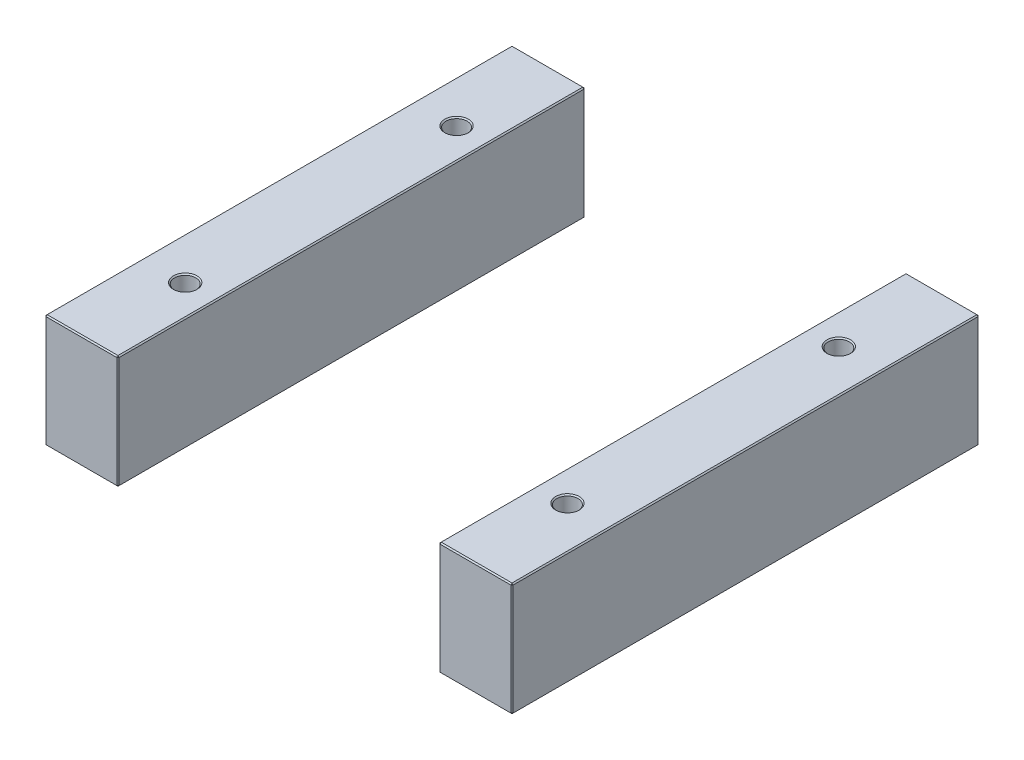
ISO-10303-21;
HEADER;
FILE_DESCRIPTION(('STEP AP214'),'2;1');
FILE_NAME('part.step','',(''),(''),'','','');
FILE_SCHEMA(('AUTOMOTIVE_DESIGN { 1 0 10303 214 1 1 1 1 }'));
ENDSEC;
DATA;
#1=APPLICATION_CONTEXT('core data for automotive mechanical design processes');
#2=APPLICATION_PROTOCOL_DEFINITION('international standard','automotive_design',2000,#1);
#3=PRODUCT_CONTEXT('',#1,'mechanical');
#4=PRODUCT('Part','Part','',(#3));
#5=PRODUCT_RELATED_PRODUCT_CATEGORY('part','',(#4));
#6=PRODUCT_DEFINITION_FORMATION('','',#4);
#7=PRODUCT_DEFINITION_CONTEXT('part definition',#1,'design');
#8=PRODUCT_DEFINITION('design','',#6,#7);
#9=PRODUCT_DEFINITION_SHAPE('','',#8);
#10=(LENGTH_UNIT() NAMED_UNIT(*) SI_UNIT(.MILLI.,.METRE.));
#11=(NAMED_UNIT(*) PLANE_ANGLE_UNIT() SI_UNIT($,.RADIAN.));
#12=(NAMED_UNIT(*) SI_UNIT($,.STERADIAN.) SOLID_ANGLE_UNIT());
#13=UNCERTAINTY_MEASURE_WITH_UNIT(LENGTH_MEASURE(1.E-05),#10,'distance_accuracy_value','');
#14=(GEOMETRIC_REPRESENTATION_CONTEXT(3) GLOBAL_UNCERTAINTY_ASSIGNED_CONTEXT((#13)) GLOBAL_UNIT_ASSIGNED_CONTEXT((#10,
#11,#12)) REPRESENTATION_CONTEXT('',''));
#15=CARTESIAN_POINT('',(0.,0.,0.));
#16=DIRECTION('',(0.,0.,1.));
#17=DIRECTION('',(1.,0.,0.));
#18=AXIS2_PLACEMENT_3D('',#15,#16,#17);
#19=CARTESIAN_POINT('',(-198.,96.,-198.));
#20=DIRECTION('',(0.,0.,1.));
#21=DIRECTION('',(1.,0.,0.));
#22=AXIS2_PLACEMENT_3D('',#19,#20,#21);
#23=PLANE('',#22);
#24=DIRECTION('',(-1.,0.,0.));
#25=VECTOR('',#24,1.);
#26=CARTESIAN_POINT('',(-198.,1.00000000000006,-198.));
#27=LINE('',#26,#25);
#28=CARTESIAN_POINT('',(-137.,1.00000000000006,-198.));
#29=VERTEX_POINT('',#28);
#30=CARTESIAN_POINT('',(-197.,1.00000000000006,-198.));
#31=VERTEX_POINT('',#30);
#32=EDGE_CURVE('P0_E137',#29,#31,#27,.T.);
#33=ORIENTED_EDGE('',*,*,#32,.T.);
#34=DIRECTION('',(0.,1.,0.));
#35=VECTOR('',#34,1.);
#36=CARTESIAN_POINT('',(-197.,96.,-198.));
#37=LINE('',#36,#35);
#38=CARTESIAN_POINT('',(-197.,95.,-198.));
#39=VERTEX_POINT('',#38);
#40=EDGE_CURVE('P0_E235',#31,#39,#37,.T.);
#41=ORIENTED_EDGE('',*,*,#40,.T.);
#42=DIRECTION('',(1.,0.,0.));
#43=VECTOR('',#42,1.);
#44=CARTESIAN_POINT('',(-198.,95.,-198.));
#45=LINE('',#44,#43);
#46=CARTESIAN_POINT('',(-137.,95.,-198.));
#47=VERTEX_POINT('',#46);
#48=EDGE_CURVE('P0_E233',#39,#47,#45,.T.);
#49=ORIENTED_EDGE('',*,*,#48,.T.);
#50=DIRECTION('',(0.,-1.,0.));
#51=VECTOR('',#50,1.);
#52=CARTESIAN_POINT('',(-137.,96.,-198.));
#53=LINE('',#52,#51);
#54=EDGE_CURVE('P0_E230',#47,#29,#53,.T.);
#55=ORIENTED_EDGE('',*,*,#54,.T.);
#56=EDGE_LOOP('',(#33,#41,#49,#55));
#57=FACE_BOUND('',#56,.T.);
#58=ADVANCED_FACE('P0_F16',(#57),#23,.F.);
#59=CARTESIAN_POINT('',(-198.,96.,198.));
#60=DIRECTION('',(1.,0.,0.));
#61=DIRECTION('',(0.,0.,-1.));
#62=AXIS2_PLACEMENT_3D('',#59,#60,#61);
#63=PLANE('',#62);
#64=DIRECTION('',(0.,1.,0.));
#65=VECTOR('',#64,1.);
#66=CARTESIAN_POINT('',(-198.,96.,197.));
#67=LINE('',#66,#65);
#68=CARTESIAN_POINT('',(-198.,1.00000000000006,197.));
#69=VERTEX_POINT('',#68);
#70=CARTESIAN_POINT('',(-198.,95.,197.));
#71=VERTEX_POINT('',#70);
#72=EDGE_CURVE('P0_E217',#69,#71,#67,.T.);
#73=ORIENTED_EDGE('',*,*,#72,.T.);
#74=DIRECTION('',(0.,0.,-1.));
#75=VECTOR('',#74,1.);
#76=CARTESIAN_POINT('',(-198.,95.,198.));
#77=LINE('',#76,#75);
#78=CARTESIAN_POINT('',(-198.,95.,-197.));
#79=VERTEX_POINT('',#78);
#80=EDGE_CURVE('P0_E228',#71,#79,#77,.T.);
#81=ORIENTED_EDGE('',*,*,#80,.T.);
#82=DIRECTION('',(0.,-1.,0.));
#83=VECTOR('',#82,1.);
#84=CARTESIAN_POINT('',(-198.,96.,-197.));
#85=LINE('',#84,#83);
#86=CARTESIAN_POINT('',(-198.,1.00000000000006,-197.));
#87=VERTEX_POINT('',#86);
#88=EDGE_CURVE('P0_E225',#79,#87,#85,.T.);
#89=ORIENTED_EDGE('',*,*,#88,.T.);
#90=DIRECTION('',(0.,0.,1.));
#91=VECTOR('',#90,1.);
#92=CARTESIAN_POINT('',(-198.,1.00000000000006,198.));
#93=LINE('',#92,#91);
#94=EDGE_CURVE('P0_E214',#87,#69,#93,.T.);
#95=ORIENTED_EDGE('',*,*,#94,.T.);
#96=EDGE_LOOP('',(#73,#81,#89,#95));
#97=FACE_BOUND('',#96,.T.);
#98=ADVANCED_FACE('P0_F302',(#97),#63,.F.);
#99=CARTESIAN_POINT('',(-198.,96.,198.));
#100=DIRECTION('',(0.,0.,-1.));
#101=DIRECTION('',(-1.,0.,0.));
#102=AXIS2_PLACEMENT_3D('',#99,#100,#101);
#103=PLANE('',#102);
#104=DIRECTION('',(-1.,0.,0.));
#105=VECTOR('',#104,1.);
#106=CARTESIAN_POINT('',(-198.,95.,198.));
#107=LINE('',#106,#105);
#108=CARTESIAN_POINT('',(-137.,95.,198.));
#109=VERTEX_POINT('',#108);
#110=CARTESIAN_POINT('',(-197.,95.,198.));
#111=VERTEX_POINT('',#110);
#112=EDGE_CURVE('P0_E242',#109,#111,#107,.T.);
#113=ORIENTED_EDGE('',*,*,#112,.T.);
#114=DIRECTION('',(0.,-1.,0.));
#115=VECTOR('',#114,1.);
#116=CARTESIAN_POINT('',(-197.,96.,198.));
#117=LINE('',#116,#115);
#118=CARTESIAN_POINT('',(-197.,1.00000000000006,198.));
#119=VERTEX_POINT('',#118);
#120=EDGE_CURVE('P0_E244',#111,#119,#117,.T.);
#121=ORIENTED_EDGE('',*,*,#120,.T.);
#122=DIRECTION('',(1.,0.,0.));
#123=VECTOR('',#122,1.);
#124=CARTESIAN_POINT('',(-136.,1.00000000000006,198.));
#125=LINE('',#124,#123);
#126=CARTESIAN_POINT('',(-137.,1.00000000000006,198.));
#127=VERTEX_POINT('',#126);
#128=EDGE_CURVE('P0_E240',#119,#127,#125,.T.);
#129=ORIENTED_EDGE('',*,*,#128,.T.);
#130=DIRECTION('',(0.,1.,0.));
#131=VECTOR('',#130,1.);
#132=CARTESIAN_POINT('',(-137.,96.,198.));
#133=LINE('',#132,#131);
#134=EDGE_CURVE('P0_E238',#127,#109,#133,.T.);
#135=ORIENTED_EDGE('',*,*,#134,.T.);
#136=EDGE_LOOP('',(#113,#121,#129,#135));
#137=FACE_BOUND('',#136,.T.);
#138=ADVANCED_FACE('P0_F341',(#137),#103,.F.);
#139=CARTESIAN_POINT('',(-136.,96.,-198.));
#140=DIRECTION('',(-1.,0.,0.));
#141=DIRECTION('',(0.,0.,1.));
#142=AXIS2_PLACEMENT_3D('',#139,#140,#141);
#143=PLANE('',#142);
#144=DIRECTION('',(0.,0.,1.));
#145=VECTOR('',#144,1.);
#146=CARTESIAN_POINT('',(-136.,95.,-198.));
#147=LINE('',#146,#145);
#148=CARTESIAN_POINT('',(-136.,95.,-197.));
#149=VERTEX_POINT('',#148);
#150=CARTESIAN_POINT('',(-136.,95.,197.));
#151=VERTEX_POINT('',#150);
#152=EDGE_CURVE('P0_E31',#149,#151,#147,.T.);
#153=ORIENTED_EDGE('',*,*,#152,.T.);
#154=DIRECTION('',(0.,-1.,0.));
#155=VECTOR('',#154,1.);
#156=CARTESIAN_POINT('',(-136.,96.,197.));
#157=LINE('',#156,#155);
#158=CARTESIAN_POINT('',(-136.,1.00000000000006,197.));
#159=VERTEX_POINT('',#158);
#160=EDGE_CURVE('P0_E190',#151,#159,#157,.T.);
#161=ORIENTED_EDGE('',*,*,#160,.T.);
#162=DIRECTION('',(0.,0.,-1.));
#163=VECTOR('',#162,1.);
#164=CARTESIAN_POINT('',(-136.,1.00000000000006,-198.));
#165=LINE('',#164,#163);
#166=CARTESIAN_POINT('',(-136.,1.00000000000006,-197.));
#167=VERTEX_POINT('',#166);
#168=EDGE_CURVE('P0_E256',#159,#167,#165,.T.);
#169=ORIENTED_EDGE('',*,*,#168,.T.);
#170=DIRECTION('',(0.,1.,0.));
#171=VECTOR('',#170,1.);
#172=CARTESIAN_POINT('',(-136.,96.,-197.));
#173=LINE('',#172,#171);
#174=EDGE_CURVE('P0_E36',#167,#149,#173,.T.);
#175=ORIENTED_EDGE('',*,*,#174,.T.);
#176=EDGE_LOOP('',(#153,#161,#169,#175));
#177=FACE_BOUND('',#176,.T.);
#178=ADVANCED_FACE('P0_F535',(#177),#143,.F.);
#179=CARTESIAN_POINT('',(0.,96.,0.));
#180=DIRECTION('',(0.,-1.,0.));
#181=DIRECTION('',(0.,0.,-1.));
#182=AXIS2_PLACEMENT_3D('',#179,#180,#181);
#183=PLANE('',#182);
#184=CARTESIAN_POINT('',(-162.,96.,115.));
#185=DIRECTION('',(0.,-1.,0.));
#186=DIRECTION('',(0.,0.,-1.));
#187=AXIS2_PLACEMENT_3D('',#184,#185,#186);
#188=CIRCLE('',#187,10.);
#189=CARTESIAN_POINT('',(-162.,96.,105.));
#190=VERTEX_POINT('',#189);
#191=EDGE_CURVE('P0_E24',#190,#190,#188,.T.);
#192=ORIENTED_EDGE('',*,*,#191,.T.);
#193=EDGE_LOOP('',(#192));
#194=FACE_BOUND('',#193,.T.);
#195=CARTESIAN_POINT('',(-162.,96.,-115.));
#196=DIRECTION('',(0.,-1.,0.));
#197=DIRECTION('',(0.,0.,-1.));
#198=AXIS2_PLACEMENT_3D('',#195,#196,#197);
#199=CIRCLE('',#198,10.);
#200=CARTESIAN_POINT('',(-162.,96.,-125.));
#201=VERTEX_POINT('',#200);
#202=EDGE_CURVE('P0_E189',#201,#201,#199,.T.);
#203=ORIENTED_EDGE('',*,*,#202,.T.);
#204=EDGE_LOOP('',(#203));
#205=FACE_BOUND('',#204,.T.);
#206=DIRECTION('',(0.,0.,1.));
#207=VECTOR('',#206,1.);
#208=CARTESIAN_POINT('',(-197.,96.,1.38076979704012E-13));
#209=LINE('',#208,#207);
#210=CARTESIAN_POINT('',(-197.,96.,-197.));
#211=VERTEX_POINT('',#210);
#212=CARTESIAN_POINT('',(-197.,96.,197.));
#213=VERTEX_POINT('',#212);
#214=EDGE_CURVE('P0_E251',#211,#213,#209,.T.);
#215=ORIENTED_EDGE('',*,*,#214,.T.);
#216=DIRECTION('',(1.,0.,0.));
#217=VECTOR('',#216,1.);
#218=CARTESIAN_POINT('',(-1.76382206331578E-13,96.,197.));
#219=LINE('',#218,#217);
#220=CARTESIAN_POINT('',(-137.,96.,197.));
#221=VERTEX_POINT('',#220);
#222=EDGE_CURVE('P0_E253',#213,#221,#219,.T.);
#223=ORIENTED_EDGE('',*,*,#222,.T.);
#224=DIRECTION('',(0.,0.,-1.));
#225=VECTOR('',#224,1.);
#226=CARTESIAN_POINT('',(-137.,96.,0.));
#227=LINE('',#226,#225);
#228=CARTESIAN_POINT('',(-137.,96.,-197.));
#229=VERTEX_POINT('',#228);
#230=EDGE_CURVE('P0_E247',#221,#229,#227,.T.);
#231=ORIENTED_EDGE('',*,*,#230,.T.);
#232=DIRECTION('',(-1.,0.,0.));
#233=VECTOR('',#232,1.);
#234=CARTESIAN_POINT('',(2.64573309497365E-13,96.,-197.));
#235=LINE('',#234,#233);
#236=EDGE_CURVE('P0_E249',#229,#211,#235,.T.);
#237=ORIENTED_EDGE('',*,*,#236,.T.);
#238=EDGE_LOOP('',(#215,#223,#231,#237));
#239=FACE_BOUND('',#238,.T.);
#240=ADVANCED_FACE('P0_F195',(#194,#205,#239),#183,.F.);
#241=CARTESIAN_POINT('',(0.,0.,0.));
#242=DIRECTION('',(0.,-1.,0.));
#243=DIRECTION('',(0.,0.,-1.));
#244=AXIS2_PLACEMENT_3D('',#241,#242,#243);
#245=PLANE('',#244);
#246=CARTESIAN_POINT('',(-162.,0.,-115.));
#247=DIRECTION('',(0.,-1.,0.));
#248=DIRECTION('',(0.,0.,-1.));
#249=AXIS2_PLACEMENT_3D('',#246,#247,#248);
#250=CIRCLE('',#249,10.);
#251=CARTESIAN_POINT('',(-162.,0.,-125.));
#252=VERTEX_POINT('',#251);
#253=EDGE_CURVE('P0_E220',#252,#252,#250,.F.);
#254=ORIENTED_EDGE('',*,*,#253,.T.);
#255=EDGE_LOOP('',(#254));
#256=FACE_BOUND('',#255,.T.);
#257=CARTESIAN_POINT('',(-162.,0.,115.));
#258=DIRECTION('',(0.,-1.,0.));
#259=DIRECTION('',(0.,0.,-1.));
#260=AXIS2_PLACEMENT_3D('',#257,#258,#259);
#261=CIRCLE('',#260,10.);
#262=CARTESIAN_POINT('',(-162.,0.,105.));
#263=VERTEX_POINT('',#262);
#264=EDGE_CURVE('P0_E608',#263,#263,#261,.F.);
#265=ORIENTED_EDGE('',*,*,#264,.T.);
#266=EDGE_LOOP('',(#265));
#267=FACE_BOUND('',#266,.T.);
#268=DIRECTION('',(-1.,0.,0.));
#269=VECTOR('',#268,1.);
#270=CARTESIAN_POINT('',(-198.,0.,197.));
#271=LINE('',#270,#269);
#272=CARTESIAN_POINT('',(-137.,0.,197.));
#273=VERTEX_POINT('',#272);
#274=CARTESIAN_POINT('',(-197.,0.,197.));
#275=VERTEX_POINT('',#274);
#276=EDGE_CURVE('P0_E114',#273,#275,#271,.T.);
#277=ORIENTED_EDGE('',*,*,#276,.T.);
#278=DIRECTION('',(0.,0.,-1.));
#279=VECTOR('',#278,1.);
#280=CARTESIAN_POINT('',(-197.,0.,-198.));
#281=LINE('',#280,#279);
#282=CARTESIAN_POINT('',(-197.,0.,-197.));
#283=VERTEX_POINT('',#282);
#284=EDGE_CURVE('P0_E110',#275,#283,#281,.T.);
#285=ORIENTED_EDGE('',*,*,#284,.T.);
#286=DIRECTION('',(1.,0.,0.));
#287=VECTOR('',#286,1.);
#288=CARTESIAN_POINT('',(-136.,0.,-197.));
#289=LINE('',#288,#287);
#290=CARTESIAN_POINT('',(-137.,0.,-197.));
#291=VERTEX_POINT('',#290);
#292=EDGE_CURVE('P0_E104',#283,#291,#289,.T.);
#293=ORIENTED_EDGE('',*,*,#292,.T.);
#294=DIRECTION('',(0.,0.,1.));
#295=VECTOR('',#294,1.);
#296=CARTESIAN_POINT('',(-137.,0.,198.));
#297=LINE('',#296,#295);
#298=EDGE_CURVE('P0_E107',#291,#273,#297,.T.);
#299=ORIENTED_EDGE('',*,*,#298,.T.);
#300=EDGE_LOOP('',(#277,#285,#293,#299));
#301=FACE_BOUND('',#300,.T.);
#302=ADVANCED_FACE('P0_F106',(#256,#267,#301),#245,.T.);
#303=CARTESIAN_POINT('',(-162.,0.,-115.));
#304=DIRECTION('',(0.,1.,0.));
#305=DIRECTION('',(0.,0.,1.));
#306=AXIS2_PLACEMENT_3D('',#303,#304,#305);
#307=CYLINDRICAL_SURFACE('',#306,9.);
#308=CARTESIAN_POINT('',(-162.,95.,-115.));
#309=DIRECTION('',(0.,-1.,0.));
#310=DIRECTION('',(0.,0.,-1.));
#311=AXIS2_PLACEMENT_3D('',#308,#309,#310);
#312=CIRCLE('',#311,9.);
#313=CARTESIAN_POINT('',(-162.,95.,-124.));
#314=VERTEX_POINT('',#313);
#315=EDGE_CURVE('P0_E10',#314,#314,#312,.F.);
#316=ORIENTED_EDGE('',*,*,#315,.T.);
#317=EDGE_LOOP('',(#316));
#318=FACE_BOUND('',#317,.T.);
#319=CARTESIAN_POINT('',(-162.,0.999999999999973,-115.));
#320=DIRECTION('',(0.,-1.,0.));
#321=DIRECTION('',(0.,0.,-1.));
#322=AXIS2_PLACEMENT_3D('',#319,#320,#321);
#323=CIRCLE('',#322,9.);
#324=CARTESIAN_POINT('',(-162.,0.999999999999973,-124.));
#325=VERTEX_POINT('',#324);
#326=EDGE_CURVE('P0_E215',#325,#325,#323,.T.);
#327=ORIENTED_EDGE('',*,*,#326,.T.);
#328=EDGE_LOOP('',(#327));
#329=FACE_BOUND('',#328,.T.);
#330=ADVANCED_FACE('P0_F208',(#318,#329),#307,.F.);
#331=CARTESIAN_POINT('',(-162.,0.,115.));
#332=DIRECTION('',(0.,1.,0.));
#333=DIRECTION('',(0.,0.,1.));
#334=AXIS2_PLACEMENT_3D('',#331,#332,#333);
#335=CYLINDRICAL_SURFACE('',#334,9.);
#336=CARTESIAN_POINT('',(-162.,95.,115.));
#337=DIRECTION('',(0.,-1.,0.));
#338=DIRECTION('',(0.,0.,-1.));
#339=AXIS2_PLACEMENT_3D('',#336,#337,#338);
#340=CIRCLE('',#339,9.);
#341=CARTESIAN_POINT('',(-162.,95.,106.));
#342=VERTEX_POINT('',#341);
#343=EDGE_CURVE('P0_E186',#342,#342,#340,.F.);
#344=ORIENTED_EDGE('',*,*,#343,.T.);
#345=EDGE_LOOP('',(#344));
#346=FACE_BOUND('',#345,.T.);
#347=CARTESIAN_POINT('',(-162.,0.999999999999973,115.));
#348=DIRECTION('',(0.,-1.,0.));
#349=DIRECTION('',(0.,0.,-1.));
#350=AXIS2_PLACEMENT_3D('',#347,#348,#349);
#351=CIRCLE('',#350,9.);
#352=CARTESIAN_POINT('',(-162.,0.999999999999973,106.));
#353=VERTEX_POINT('',#352);
#354=EDGE_CURVE('P0_E212',#353,#353,#351,.T.);
#355=ORIENTED_EDGE('',*,*,#354,.T.);
#356=EDGE_LOOP('',(#355));
#357=FACE_BOUND('',#356,.T.);
#358=ADVANCED_FACE('P0_F204',(#346,#357),#335,.F.);
#359=CARTESIAN_POINT('',(-162.,0.,-115.));
#360=DIRECTION('',(0.,-1.,0.));
#361=DIRECTION('',(0.,0.,-1.));
#362=AXIS2_PLACEMENT_3D('',#359,#360,#361);
#363=CONICAL_SURFACE('',#362,10.,0.78539816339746);
#364=ORIENTED_EDGE('',*,*,#326,.F.);
#365=EDGE_LOOP('',(#364));
#366=FACE_BOUND('',#365,.T.);
#367=ORIENTED_EDGE('',*,*,#253,.F.);
#368=EDGE_LOOP('',(#367));
#369=FACE_BOUND('',#368,.T.);
#370=ADVANCED_FACE('P0_F207',(#366,#369),#363,.F.);
#371=CARTESIAN_POINT('',(-162.,0.,115.));
#372=DIRECTION('',(0.,-1.,0.));
#373=DIRECTION('',(0.,0.,-1.));
#374=AXIS2_PLACEMENT_3D('',#371,#372,#373);
#375=CONICAL_SURFACE('',#374,10.,0.78539816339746);
#376=ORIENTED_EDGE('',*,*,#354,.F.);
#377=EDGE_LOOP('',(#376));
#378=FACE_BOUND('',#377,.T.);
#379=ORIENTED_EDGE('',*,*,#264,.F.);
#380=EDGE_LOOP('',(#379));
#381=FACE_BOUND('',#380,.T.);
#382=ADVANCED_FACE('P0_F347',(#378,#381),#375,.F.);
#383=CARTESIAN_POINT('',(-136.,96.,197.));
#384=DIRECTION('',(-0.707106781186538,0.,-0.707106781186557));
#385=DIRECTION('',(0.,-1.,0.));
#386=AXIS2_PLACEMENT_3D('',#383,#384,#385);
#387=PLANE('',#386);
#388=DIRECTION('',(-0.707106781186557,0.,0.707106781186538));
#389=VECTOR('',#388,1.);
#390=CARTESIAN_POINT('',(-136.5,95.,197.5));
#391=LINE('',#390,#389);
#392=EDGE_CURVE('P0_E125',#109,#151,#391,.F.);
#393=ORIENTED_EDGE('',*,*,#392,.F.);
#394=ORIENTED_EDGE('',*,*,#134,.F.);
#395=DIRECTION('',(0.707106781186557,0.,-0.707106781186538));
#396=VECTOR('',#395,1.);
#397=CARTESIAN_POINT('',(-137.,1.00000000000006,198.));
#398=LINE('',#397,#396);
#399=EDGE_CURVE('P0_E181',#159,#127,#398,.F.);
#400=ORIENTED_EDGE('',*,*,#399,.F.);
#401=ORIENTED_EDGE('',*,*,#160,.F.);
#402=EDGE_LOOP('',(#393,#394,#400,#401));
#403=FACE_BOUND('',#402,.T.);
#404=ADVANCED_FACE('P0_F351',(#403),#387,.F.);
#405=CARTESIAN_POINT('',(-137.,96.,197.));
#406=DIRECTION('',(0.577350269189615,0.577350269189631,0.577350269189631));
#407=DIRECTION('',(0.,-0.707106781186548,0.707106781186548));
#408=AXIS2_PLACEMENT_3D('',#405,#406,#407);
#409=PLANE('',#408);
#410=DIRECTION('',(0.,0.707106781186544,-0.707106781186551));
#411=VECTOR('',#410,1.);
#412=CARTESIAN_POINT('',(-137.,96.,197.));
#413=LINE('',#412,#411);
#414=EDGE_CURVE('P0_E175',#109,#221,#413,.T.);
#415=ORIENTED_EDGE('',*,*,#414,.F.);
#416=ORIENTED_EDGE('',*,*,#392,.T.);
#417=DIRECTION('',(0.707106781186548,-0.707106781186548,0.));
#418=VECTOR('',#417,1.);
#419=CARTESIAN_POINT('',(-137.,96.,197.));
#420=LINE('',#419,#418);
#421=EDGE_CURVE('P0_E178',#221,#151,#420,.T.);
#422=ORIENTED_EDGE('',*,*,#421,.F.);
#423=EDGE_LOOP('',(#415,#416,#422));
#424=FACE_BOUND('',#423,.T.);
#425=ADVANCED_FACE('P0_F487',(#424),#409,.T.);
#426=CARTESIAN_POINT('',(-137.,1.00000000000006,198.));
#427=DIRECTION('',(0.577350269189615,-0.577350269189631,0.577350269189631));
#428=DIRECTION('',(0.,-0.707106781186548,-0.707106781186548));
#429=AXIS2_PLACEMENT_3D('',#426,#427,#428);
#430=PLANE('',#429);
#431=DIRECTION('',(0.707106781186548,0.707106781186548,0.));
#432=VECTOR('',#431,1.);
#433=CARTESIAN_POINT('',(-136.5,0.500000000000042,197.));
#434=LINE('',#433,#432);
#435=EDGE_CURVE('P0_E123',#159,#273,#434,.F.);
#436=ORIENTED_EDGE('',*,*,#435,.F.);
#437=ORIENTED_EDGE('',*,*,#399,.T.);
#438=DIRECTION('',(0.,-0.707106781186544,-0.707106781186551));
#439=VECTOR('',#438,1.);
#440=CARTESIAN_POINT('',(-137.,1.00000000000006,198.));
#441=LINE('',#440,#439);
#442=EDGE_CURVE('P0_E172',#273,#127,#441,.F.);
#443=ORIENTED_EDGE('',*,*,#442,.F.);
#444=EDGE_LOOP('',(#436,#437,#443));
#445=FACE_BOUND('',#444,.T.);
#446=ADVANCED_FACE('P0_F478',(#445),#430,.T.);
#447=CARTESIAN_POINT('',(-137.,96.,0.));
#448=DIRECTION('',(-0.707106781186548,-0.707106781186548,0.));
#449=DIRECTION('',(0.,0.,-1.));
#450=AXIS2_PLACEMENT_3D('',#447,#448,#449);
#451=PLANE('',#450);
#452=ORIENTED_EDGE('',*,*,#421,.T.);
#453=ORIENTED_EDGE('',*,*,#152,.F.);
#454=DIRECTION('',(-0.707106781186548,0.707106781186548,0.));
#455=VECTOR('',#454,1.);
#456=CARTESIAN_POINT('',(-136.5,95.5,-197.));
#457=LINE('',#456,#455);
#458=EDGE_CURVE('P0_E165',#229,#149,#457,.F.);
#459=ORIENTED_EDGE('',*,*,#458,.F.);
#460=ORIENTED_EDGE('',*,*,#230,.F.);
#461=EDGE_LOOP('',(#452,#453,#459,#460));
#462=FACE_BOUND('',#461,.T.);
#463=ADVANCED_FACE('P0_F318',(#462),#451,.F.);
#464=CARTESIAN_POINT('',(-1.76382206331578E-13,96.,197.));
#465=DIRECTION('',(0.,-0.707106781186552,-0.707106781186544));
#466=DIRECTION('',(1.,0.,0.));
#467=AXIS2_PLACEMENT_3D('',#464,#465,#466);
#468=PLANE('',#467);
#469=ORIENTED_EDGE('',*,*,#414,.T.);
#470=ORIENTED_EDGE('',*,*,#222,.F.);
#471=DIRECTION('',(0.,-0.707106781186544,0.707106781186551));
#472=VECTOR('',#471,1.);
#473=CARTESIAN_POINT('',(-197.,95.5,197.5));
#474=LINE('',#473,#472);
#475=EDGE_CURVE('P0_E162',#111,#213,#474,.F.);
#476=ORIENTED_EDGE('',*,*,#475,.F.);
#477=ORIENTED_EDGE('',*,*,#112,.F.);
#478=EDGE_LOOP('',(#469,#470,#476,#477));
#479=FACE_BOUND('',#478,.T.);
#480=ADVANCED_FACE('P0_F313',(#479),#468,.F.);
#481=CARTESIAN_POINT('',(-197.,96.,198.));
#482=DIRECTION('',(0.707106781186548,0.,-0.707106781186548));
#483=DIRECTION('',(0.,-1.,0.));
#484=AXIS2_PLACEMENT_3D('',#481,#482,#483);
#485=PLANE('',#484);
#486=DIRECTION('',(0.707106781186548,0.,0.707106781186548));
#487=VECTOR('',#486,1.);
#488=CARTESIAN_POINT('',(-197.,1.00000000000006,198.));
#489=LINE('',#488,#487);
#490=EDGE_CURVE('P0_E156',#119,#69,#489,.F.);
#491=ORIENTED_EDGE('',*,*,#490,.F.);
#492=ORIENTED_EDGE('',*,*,#120,.F.);
#493=DIRECTION('',(-0.707106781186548,0.,-0.707106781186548));
#494=VECTOR('',#493,1.);
#495=CARTESIAN_POINT('',(-198.,95.,197.));
#496=LINE('',#495,#494);
#497=EDGE_CURVE('P0_E159',#71,#111,#496,.F.);
#498=ORIENTED_EDGE('',*,*,#497,.F.);
#499=ORIENTED_EDGE('',*,*,#72,.F.);
#500=EDGE_LOOP('',(#491,#492,#498,#499));
#501=FACE_BOUND('',#500,.T.);
#502=ADVANCED_FACE('P0_F307',(#501),#485,.F.);
#503=CARTESIAN_POINT('',(-198.,1.00000000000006,198.));
#504=DIRECTION('',(0.,-0.707106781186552,0.707106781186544));
#505=DIRECTION('',(-1.,0.,0.));
#506=AXIS2_PLACEMENT_3D('',#503,#504,#505);
#507=PLANE('',#506);
#508=ORIENTED_EDGE('',*,*,#442,.T.);
#509=ORIENTED_EDGE('',*,*,#128,.F.);
#510=DIRECTION('',(0.,0.707106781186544,0.707106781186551));
#511=VECTOR('',#510,1.);
#512=CARTESIAN_POINT('',(-197.,1.00000000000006,198.));
#513=LINE('',#512,#511);
#514=EDGE_CURVE('P0_E134',#275,#119,#513,.T.);
#515=ORIENTED_EDGE('',*,*,#514,.F.);
#516=ORIENTED_EDGE('',*,*,#276,.F.);
#517=EDGE_LOOP('',(#508,#509,#515,#516));
#518=FACE_BOUND('',#517,.T.);
#519=ADVANCED_FACE('P0_F333',(#518),#507,.T.);
#520=CARTESIAN_POINT('',(-136.,1.00000000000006,-198.));
#521=DIRECTION('',(0.707106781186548,-0.707106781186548,0.));
#522=DIRECTION('',(0.,0.,1.));
#523=AXIS2_PLACEMENT_3D('',#520,#521,#522);
#524=PLANE('',#523);
#525=ORIENTED_EDGE('',*,*,#435,.T.);
#526=ORIENTED_EDGE('',*,*,#298,.F.);
#527=DIRECTION('',(-0.707106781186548,-0.707106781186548,0.));
#528=VECTOR('',#527,1.);
#529=CARTESIAN_POINT('',(-137.,0.,-197.));
#530=LINE('',#529,#528);
#531=EDGE_CURVE('P0_E120',#167,#291,#530,.T.);
#532=ORIENTED_EDGE('',*,*,#531,.F.);
#533=ORIENTED_EDGE('',*,*,#168,.F.);
#534=EDGE_LOOP('',(#525,#526,#532,#533));
#535=FACE_BOUND('',#534,.T.);
#536=ADVANCED_FACE('P0_F119',(#535),#524,.T.);
#537=CARTESIAN_POINT('',(-137.,96.,-198.));
#538=DIRECTION('',(-0.707106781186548,0.,0.707106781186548));
#539=DIRECTION('',(0.,-1.,0.));
#540=AXIS2_PLACEMENT_3D('',#537,#538,#539);
#541=PLANE('',#540);
#542=DIRECTION('',(0.707106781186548,0.,0.707106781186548));
#543=VECTOR('',#542,1.);
#544=CARTESIAN_POINT('',(-137.,95.,-198.));
#545=LINE('',#544,#543);
#546=EDGE_CURVE('P0_E168',#149,#47,#545,.F.);
#547=ORIENTED_EDGE('',*,*,#546,.F.);
#548=ORIENTED_EDGE('',*,*,#174,.F.);
#549=DIRECTION('',(-0.707106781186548,0.,-0.707106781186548));
#550=VECTOR('',#549,1.);
#551=CARTESIAN_POINT('',(-136.5,1.00000000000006,-197.5));
#552=LINE('',#551,#550);
#553=EDGE_CURVE('P0_E133',#29,#167,#552,.F.);
#554=ORIENTED_EDGE('',*,*,#553,.F.);
#555=ORIENTED_EDGE('',*,*,#54,.F.);
#556=EDGE_LOOP('',(#547,#548,#554,#555));
#557=FACE_BOUND('',#556,.T.);
#558=ADVANCED_FACE('P0_F323',(#557),#541,.F.);
#559=CARTESIAN_POINT('',(-137.,95.,-198.));
#560=DIRECTION('',(0.577350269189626,0.577350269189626,-0.577350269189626));
#561=DIRECTION('',(-0.707106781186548,0.,-0.707106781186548));
#562=AXIS2_PLACEMENT_3D('',#559,#560,#561);
#563=PLANE('',#562);
#564=ORIENTED_EDGE('',*,*,#458,.T.);
#565=ORIENTED_EDGE('',*,*,#546,.T.);
#566=DIRECTION('',(0.,-0.707106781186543,-0.707106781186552));
#567=VECTOR('',#566,1.);
#568=CARTESIAN_POINT('',(-137.,95.,-198.));
#569=LINE('',#568,#567);
#570=EDGE_CURVE('P0_E151',#229,#47,#569,.T.);
#571=ORIENTED_EDGE('',*,*,#570,.F.);
#572=EDGE_LOOP('',(#564,#565,#571));
#573=FACE_BOUND('',#572,.T.);
#574=ADVANCED_FACE('P0_F321',(#573),#563,.T.);
#575=CARTESIAN_POINT('',(-198.,95.,197.));
#576=DIRECTION('',(-0.577350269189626,0.577350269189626,0.577350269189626));
#577=DIRECTION('',(0.707106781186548,0.,0.707106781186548));
#578=AXIS2_PLACEMENT_3D('',#575,#576,#577);
#579=PLANE('',#578);
#580=ORIENTED_EDGE('',*,*,#497,.T.);
#581=ORIENTED_EDGE('',*,*,#475,.T.);
#582=DIRECTION('',(0.707106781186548,0.707106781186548,0.));
#583=VECTOR('',#582,1.);
#584=CARTESIAN_POINT('',(-198.,95.,197.));
#585=LINE('',#584,#583);
#586=EDGE_CURVE('P0_E142',#71,#213,#585,.T.);
#587=ORIENTED_EDGE('',*,*,#586,.F.);
#588=EDGE_LOOP('',(#580,#581,#587));
#589=FACE_BOUND('',#588,.T.);
#590=ADVANCED_FACE('P0_F310',(#589),#579,.T.);
#591=CARTESIAN_POINT('',(-197.,1.00000000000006,198.));
#592=DIRECTION('',(-0.577350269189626,-0.577350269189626,0.577350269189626));
#593=DIRECTION('',(0.707106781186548,0.,0.707106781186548));
#594=AXIS2_PLACEMENT_3D('',#591,#592,#593);
#595=PLANE('',#594);
#596=ORIENTED_EDGE('',*,*,#514,.T.);
#597=ORIENTED_EDGE('',*,*,#490,.T.);
#598=DIRECTION('',(0.707106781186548,-0.707106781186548,0.));
#599=VECTOR('',#598,1.);
#600=CARTESIAN_POINT('',(-197.5,0.500000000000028,197.));
#601=LINE('',#600,#599);
#602=EDGE_CURVE('P0_E138',#275,#69,#601,.F.);
#603=ORIENTED_EDGE('',*,*,#602,.F.);
#604=EDGE_LOOP('',(#596,#597,#603));
#605=FACE_BOUND('',#604,.T.);
#606=ADVANCED_FACE('P0_F368',(#605),#595,.T.);
#607=CARTESIAN_POINT('',(-137.,0.,-197.));
#608=DIRECTION('',(0.577350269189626,-0.577350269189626,-0.577350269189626));
#609=DIRECTION('',(-0.707106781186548,0.,-0.707106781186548));
#610=AXIS2_PLACEMENT_3D('',#607,#608,#609);
#611=PLANE('',#610);
#612=ORIENTED_EDGE('',*,*,#553,.T.);
#613=ORIENTED_EDGE('',*,*,#531,.T.);
#614=DIRECTION('',(0.,0.707106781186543,-0.707106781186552));
#615=VECTOR('',#614,1.);
#616=CARTESIAN_POINT('',(-137.,0.,-197.));
#617=LINE('',#616,#615);
#618=EDGE_CURVE('P0_E130',#29,#291,#617,.F.);
#619=ORIENTED_EDGE('',*,*,#618,.F.);
#620=EDGE_LOOP('',(#612,#613,#619));
#621=FACE_BOUND('',#620,.T.);
#622=ADVANCED_FACE('P0_F129',(#621),#611,.T.);
#623=CARTESIAN_POINT('',(2.64573309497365E-13,96.,-197.));
#624=DIRECTION('',(0.,-0.707106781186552,0.707106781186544));
#625=DIRECTION('',(-1.,0.,0.));
#626=AXIS2_PLACEMENT_3D('',#623,#624,#625);
#627=PLANE('',#626);
#628=ORIENTED_EDGE('',*,*,#570,.T.);
#629=ORIENTED_EDGE('',*,*,#48,.F.);
#630=DIRECTION('',(0.,0.707106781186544,0.707106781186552));
#631=VECTOR('',#630,1.);
#632=CARTESIAN_POINT('',(-197.,95.,-198.));
#633=LINE('',#632,#631);
#634=EDGE_CURVE('P0_E139',#211,#39,#633,.F.);
#635=ORIENTED_EDGE('',*,*,#634,.F.);
#636=ORIENTED_EDGE('',*,*,#236,.F.);
#637=EDGE_LOOP('',(#628,#629,#635,#636));
#638=FACE_BOUND('',#637,.T.);
#639=ADVANCED_FACE('P0_F286',(#638),#627,.F.);
#640=CARTESIAN_POINT('',(-197.,96.,1.38076979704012E-13));
#641=DIRECTION('',(0.707106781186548,-0.707106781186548,0.));
#642=DIRECTION('',(0.,0.,1.));
#643=AXIS2_PLACEMENT_3D('',#640,#641,#642);
#644=PLANE('',#643);
#645=ORIENTED_EDGE('',*,*,#586,.T.);
#646=ORIENTED_EDGE('',*,*,#214,.F.);
#647=DIRECTION('',(-0.707106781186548,-0.707106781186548,0.));
#648=VECTOR('',#647,1.);
#649=CARTESIAN_POINT('',(-197.5,95.5,-197.));
#650=LINE('',#649,#648);
#651=EDGE_CURVE('P0_E145',#79,#211,#650,.F.);
#652=ORIENTED_EDGE('',*,*,#651,.F.);
#653=ORIENTED_EDGE('',*,*,#80,.F.);
#654=EDGE_LOOP('',(#645,#646,#652,#653));
#655=FACE_BOUND('',#654,.T.);
#656=ADVANCED_FACE('P0_F280',(#655),#644,.F.);
#657=CARTESIAN_POINT('',(-198.,1.00000000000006,198.));
#658=DIRECTION('',(-0.707106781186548,-0.707106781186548,0.));
#659=DIRECTION('',(0.,0.,-1.));
#660=AXIS2_PLACEMENT_3D('',#657,#658,#659);
#661=PLANE('',#660);
#662=ORIENTED_EDGE('',*,*,#602,.T.);
#663=ORIENTED_EDGE('',*,*,#94,.F.);
#664=DIRECTION('',(-0.707106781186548,0.707106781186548,0.));
#665=VECTOR('',#664,1.);
#666=CARTESIAN_POINT('',(-198.,1.00000000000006,-197.));
#667=LINE('',#666,#665);
#668=EDGE_CURVE('P0_E267',#283,#87,#667,.T.);
#669=ORIENTED_EDGE('',*,*,#668,.F.);
#670=ORIENTED_EDGE('',*,*,#284,.F.);
#671=EDGE_LOOP('',(#662,#663,#669,#670));
#672=FACE_BOUND('',#671,.T.);
#673=ADVANCED_FACE('P0_F298',(#672),#661,.T.);
#674=CARTESIAN_POINT('',(-198.,1.00000000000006,-198.));
#675=DIRECTION('',(0.,-0.707106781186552,-0.707106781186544));
#676=DIRECTION('',(1.,0.,0.));
#677=AXIS2_PLACEMENT_3D('',#674,#675,#676);
#678=PLANE('',#677);
#679=ORIENTED_EDGE('',*,*,#618,.T.);
#680=ORIENTED_EDGE('',*,*,#292,.F.);
#681=DIRECTION('',(0.,-0.707106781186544,0.707106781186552));
#682=VECTOR('',#681,1.);
#683=CARTESIAN_POINT('',(-197.,0.500000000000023,-197.5));
#684=LINE('',#683,#682);
#685=EDGE_CURVE('P0_E265',#31,#283,#684,.T.);
#686=ORIENTED_EDGE('',*,*,#685,.F.);
#687=ORIENTED_EDGE('',*,*,#32,.F.);
#688=EDGE_LOOP('',(#679,#680,#686,#687));
#689=FACE_BOUND('',#688,.T.);
#690=ADVANCED_FACE('P0_F136',(#689),#678,.T.);
#691=CARTESIAN_POINT('',(-197.,95.,-198.));
#692=DIRECTION('',(-0.577350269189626,0.577350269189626,-0.577350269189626));
#693=DIRECTION('',(-0.707106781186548,0.,0.707106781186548));
#694=AXIS2_PLACEMENT_3D('',#691,#692,#693);
#695=PLANE('',#694);
#696=ORIENTED_EDGE('',*,*,#651,.T.);
#697=ORIENTED_EDGE('',*,*,#634,.T.);
#698=DIRECTION('',(0.707106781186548,0.,-0.707106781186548));
#699=VECTOR('',#698,1.);
#700=CARTESIAN_POINT('',(-197.,95.,-198.));
#701=LINE('',#700,#699);
#702=EDGE_CURVE('P0_E263',#79,#39,#701,.T.);
#703=ORIENTED_EDGE('',*,*,#702,.F.);
#704=EDGE_LOOP('',(#696,#697,#703));
#705=FACE_BOUND('',#704,.T.);
#706=ADVANCED_FACE('P0_F273',(#705),#695,.T.);
#707=CARTESIAN_POINT('',(-198.,1.00000000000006,-197.));
#708=DIRECTION('',(-0.577350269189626,-0.577350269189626,-0.577350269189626));
#709=DIRECTION('',(-0.707106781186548,0.,0.707106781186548));
#710=AXIS2_PLACEMENT_3D('',#707,#708,#709);
#711=PLANE('',#710);
#712=ORIENTED_EDGE('',*,*,#685,.T.);
#713=ORIENTED_EDGE('',*,*,#668,.T.);
#714=DIRECTION('',(-0.707106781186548,0.,0.707106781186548));
#715=VECTOR('',#714,1.);
#716=CARTESIAN_POINT('',(-198.,1.00000000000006,-197.));
#717=LINE('',#716,#715);
#718=EDGE_CURVE('P0_E261',#31,#87,#717,.T.);
#719=ORIENTED_EDGE('',*,*,#718,.F.);
#720=EDGE_LOOP('',(#712,#713,#719));
#721=FACE_BOUND('',#720,.T.);
#722=ADVANCED_FACE('P0_F294',(#721),#711,.T.);
#723=CARTESIAN_POINT('',(-198.,96.,-197.));
#724=DIRECTION('',(0.707106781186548,0.,0.707106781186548));
#725=DIRECTION('',(0.,-1.,0.));
#726=AXIS2_PLACEMENT_3D('',#723,#724,#725);
#727=PLANE('',#726);
#728=ORIENTED_EDGE('',*,*,#702,.T.);
#729=ORIENTED_EDGE('',*,*,#40,.F.);
#730=ORIENTED_EDGE('',*,*,#718,.T.);
#731=ORIENTED_EDGE('',*,*,#88,.F.);
#732=EDGE_LOOP('',(#728,#729,#730,#731));
#733=FACE_BOUND('',#732,.T.);
#734=ADVANCED_FACE('P0_F201',(#733),#727,.F.);
#735=CARTESIAN_POINT('',(-162.,95.,115.));
#736=DIRECTION('',(0.,1.,0.));
#737=DIRECTION('',(0.,0.,1.));
#738=AXIS2_PLACEMENT_3D('',#735,#736,#737);
#739=CONICAL_SURFACE('',#738,9.,0.785398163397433);
#740=ORIENTED_EDGE('',*,*,#191,.F.);
#741=EDGE_LOOP('',(#740));
#742=FACE_BOUND('',#741,.T.);
#743=ORIENTED_EDGE('',*,*,#343,.F.);
#744=EDGE_LOOP('',(#743));
#745=FACE_BOUND('',#744,.T.);
#746=ADVANCED_FACE('P0_F198',(#742,#745),#739,.F.);
#747=CARTESIAN_POINT('',(-162.,95.,-115.));
#748=DIRECTION('',(0.,1.,0.));
#749=DIRECTION('',(0.,0.,1.));
#750=AXIS2_PLACEMENT_3D('',#747,#748,#749);
#751=CONICAL_SURFACE('',#750,9.,0.78539816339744);
#752=ORIENTED_EDGE('',*,*,#202,.F.);
#753=EDGE_LOOP('',(#752));
#754=FACE_BOUND('',#753,.T.);
#755=ORIENTED_EDGE('',*,*,#315,.F.);
#756=EDGE_LOOP('',(#755));
#757=FACE_BOUND('',#756,.T.);
#758=ADVANCED_FACE('P0_F18',(#754,#757),#751,.F.);
#759=CLOSED_SHELL('',(#58,#98,#138,#178,#240,#302,#330,#358,#370,#382,#404,#425,#446,#463,#480,
#502,#519,#536,#558,#574,#590,#606,#622,#639,#656,#673,#690,#706,#722,#734,#746,#758));
#760=MANIFOLD_SOLID_BREP('P0_B1',#759);
#761=CARTESIAN_POINT('',(198.,96.,198.));
#762=DIRECTION('',(0.,0.,-1.));
#763=DIRECTION('',(-1.,0.,0.));
#764=AXIS2_PLACEMENT_3D('',#761,#762,#763);
#765=PLANE('',#764);
#766=DIRECTION('',(0.,-1.,0.));
#767=VECTOR('',#766,1.);
#768=CARTESIAN_POINT('',(137.,96.,198.));
#769=LINE('',#768,#767);
#770=CARTESIAN_POINT('',(137.,95.,198.));
#771=VERTEX_POINT('',#770);
#772=CARTESIAN_POINT('',(137.,1.00000000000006,198.));
#773=VERTEX_POINT('',#772);
#774=EDGE_CURVE('P1_E174',#771,#773,#769,.T.);
#775=ORIENTED_EDGE('',*,*,#774,.T.);
#776=DIRECTION('',(1.,0.,0.));
#777=VECTOR('',#776,1.);
#778=CARTESIAN_POINT('',(198.,1.00000000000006,198.));
#779=LINE('',#778,#777);
#780=CARTESIAN_POINT('',(197.,1.00000000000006,198.));
#781=VERTEX_POINT('',#780);
#782=EDGE_CURVE('P1_E176',#773,#781,#779,.T.);
#783=ORIENTED_EDGE('',*,*,#782,.T.);
#784=DIRECTION('',(0.,1.,0.));
#785=VECTOR('',#784,1.);
#786=CARTESIAN_POINT('',(197.,96.,198.));
#787=LINE('',#786,#785);
#788=CARTESIAN_POINT('',(197.,95.,198.));
#789=VERTEX_POINT('',#788);
#790=EDGE_CURVE('P1_E172',#781,#789,#787,.T.);
#791=ORIENTED_EDGE('',*,*,#790,.T.);
#792=DIRECTION('',(-1.,0.,0.));
#793=VECTOR('',#792,1.);
#794=CARTESIAN_POINT('',(136.,95.,198.));
#795=LINE('',#794,#793);
#796=EDGE_CURVE('P1_E170',#789,#771,#795,.T.);
#797=ORIENTED_EDGE('',*,*,#796,.T.);
#798=EDGE_LOOP('',(#775,#783,#791,#797));
#799=FACE_BOUND('',#798,.T.);
#800=ADVANCED_FACE('P1_F17',(#799),#765,.F.);
#801=CARTESIAN_POINT('',(198.,96.,198.));
#802=DIRECTION('',(-1.,0.,0.));
#803=DIRECTION('',(0.,0.,1.));
#804=AXIS2_PLACEMENT_3D('',#801,#802,#803);
#805=PLANE('',#804);
#806=DIRECTION('',(0.,0.,1.));
#807=VECTOR('',#806,1.);
#808=CARTESIAN_POINT('',(198.,95.,198.));
#809=LINE('',#808,#807);
#810=CARTESIAN_POINT('',(198.,95.,-197.));
#811=VERTEX_POINT('',#810);
#812=CARTESIAN_POINT('',(198.,95.,197.));
#813=VERTEX_POINT('',#812);
#814=EDGE_CURVE('P1_E188',#811,#813,#809,.T.);
#815=ORIENTED_EDGE('',*,*,#814,.T.);
#816=DIRECTION('',(0.,-1.,0.));
#817=VECTOR('',#816,1.);
#818=CARTESIAN_POINT('',(198.,96.,197.));
#819=LINE('',#818,#817);
#820=CARTESIAN_POINT('',(198.,1.00000000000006,197.));
#821=VERTEX_POINT('',#820);
#822=EDGE_CURVE('P1_E194',#813,#821,#819,.T.);
#823=ORIENTED_EDGE('',*,*,#822,.T.);
#824=DIRECTION('',(0.,0.,-1.));
#825=VECTOR('',#824,1.);
#826=CARTESIAN_POINT('',(198.,1.00000000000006,198.));
#827=LINE('',#826,#825);
#828=CARTESIAN_POINT('',(198.,1.00000000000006,-197.));
#829=VERTEX_POINT('',#828);
#830=EDGE_CURVE('P1_E192',#821,#829,#827,.T.);
#831=ORIENTED_EDGE('',*,*,#830,.T.);
#832=DIRECTION('',(0.,1.,0.));
#833=VECTOR('',#832,1.);
#834=CARTESIAN_POINT('',(198.,96.,-197.));
#835=LINE('',#834,#833);
#836=EDGE_CURVE('P1_E190',#829,#811,#835,.T.);
#837=ORIENTED_EDGE('',*,*,#836,.T.);
#838=EDGE_LOOP('',(#815,#823,#831,#837));
#839=FACE_BOUND('',#838,.T.);
#840=ADVANCED_FACE('P1_F276',(#839),#805,.F.);
#841=CARTESIAN_POINT('',(198.,96.,-198.));
#842=DIRECTION('',(0.,0.,1.));
#843=DIRECTION('',(1.,0.,0.));
#844=AXIS2_PLACEMENT_3D('',#841,#842,#843);
#845=PLANE('',#844);
#846=DIRECTION('',(0.,-1.,0.));
#847=VECTOR('',#846,1.);
#848=CARTESIAN_POINT('',(197.,96.,-198.));
#849=LINE('',#848,#847);
#850=CARTESIAN_POINT('',(197.,95.,-198.));
#851=VERTEX_POINT('',#850);
#852=CARTESIAN_POINT('',(197.,1.00000000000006,-198.));
#853=VERTEX_POINT('',#852);
#854=EDGE_CURVE('P1_E165',#851,#853,#849,.T.);
#855=ORIENTED_EDGE('',*,*,#854,.T.);
#856=DIRECTION('',(-1.,0.,0.));
#857=VECTOR('',#856,1.);
#858=CARTESIAN_POINT('',(198.,1.00000000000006,-198.));
#859=LINE('',#858,#857);
#860=CARTESIAN_POINT('',(137.,1.00000000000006,-198.));
#861=VERTEX_POINT('',#860);
#862=EDGE_CURVE('P1_E113',#853,#861,#859,.T.);
#863=ORIENTED_EDGE('',*,*,#862,.T.);
#864=DIRECTION('',(0.,1.,0.));
#865=VECTOR('',#864,1.);
#866=CARTESIAN_POINT('',(137.,96.,-198.));
#867=LINE('',#866,#865);
#868=CARTESIAN_POINT('',(137.,95.,-198.));
#869=VERTEX_POINT('',#868);
#870=EDGE_CURVE('P1_E167',#861,#869,#867,.T.);
#871=ORIENTED_EDGE('',*,*,#870,.T.);
#872=DIRECTION('',(1.,0.,0.));
#873=VECTOR('',#872,1.);
#874=CARTESIAN_POINT('',(198.,95.,-198.));
#875=LINE('',#874,#873);
#876=EDGE_CURVE('P1_E163',#869,#851,#875,.T.);
#877=ORIENTED_EDGE('',*,*,#876,.T.);
#878=EDGE_LOOP('',(#855,#863,#871,#877));
#879=FACE_BOUND('',#878,.T.);
#880=ADVANCED_FACE('P1_F333',(#879),#845,.F.);
#881=CARTESIAN_POINT('',(136.,96.,-198.));
#882=DIRECTION('',(1.,0.,0.));
#883=DIRECTION('',(0.,0.,-1.));
#884=AXIS2_PLACEMENT_3D('',#881,#882,#883);
#885=PLANE('',#884);
#886=DIRECTION('',(0.,0.,-1.));
#887=VECTOR('',#886,1.);
#888=CARTESIAN_POINT('',(136.,95.,-198.));
#889=LINE('',#888,#887);
#890=CARTESIAN_POINT('',(136.,95.,197.));
#891=VERTEX_POINT('',#890);
#892=CARTESIAN_POINT('',(136.,95.,-197.));
#893=VERTEX_POINT('',#892);
#894=EDGE_CURVE('P1_E179',#891,#893,#889,.T.);
#895=ORIENTED_EDGE('',*,*,#894,.T.);
#896=DIRECTION('',(0.,-1.,0.));
#897=VECTOR('',#896,1.);
#898=CARTESIAN_POINT('',(136.,96.,-197.));
#899=LINE('',#898,#897);
#900=CARTESIAN_POINT('',(136.,1.00000000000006,-197.));
#901=VERTEX_POINT('',#900);
#902=EDGE_CURVE('P1_E185',#893,#901,#899,.T.);
#903=ORIENTED_EDGE('',*,*,#902,.T.);
#904=DIRECTION('',(0.,0.,1.));
#905=VECTOR('',#904,1.);
#906=CARTESIAN_POINT('',(136.,1.00000000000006,-198.));
#907=LINE('',#906,#905);
#908=CARTESIAN_POINT('',(136.,1.00000000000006,197.));
#909=VERTEX_POINT('',#908);
#910=EDGE_CURVE('P1_E183',#901,#909,#907,.T.);
#911=ORIENTED_EDGE('',*,*,#910,.T.);
#912=DIRECTION('',(0.,1.,0.));
#913=VECTOR('',#912,1.);
#914=CARTESIAN_POINT('',(136.,96.,197.));
#915=LINE('',#914,#913);
#916=EDGE_CURVE('P1_E181',#909,#891,#915,.T.);
#917=ORIENTED_EDGE('',*,*,#916,.T.);
#918=EDGE_LOOP('',(#895,#903,#911,#917));
#919=FACE_BOUND('',#918,.T.);
#920=ADVANCED_FACE('P1_F544',(#919),#885,.F.);
#921=CARTESIAN_POINT('',(0.,96.,0.));
#922=DIRECTION('',(0.,1.,0.));
#923=DIRECTION('',(0.,0.,1.));
#924=AXIS2_PLACEMENT_3D('',#921,#922,#923);
#925=PLANE('',#924);
#926=DIRECTION('',(-1.,0.,0.));
#927=VECTOR('',#926,1.);
#928=CARTESIAN_POINT('',(136.,96.,-197.));
#929=LINE('',#928,#927);
#930=CARTESIAN_POINT('',(197.,96.,-197.));
#931=VERTEX_POINT('',#930);
#932=CARTESIAN_POINT('',(137.,96.,-197.));
#933=VERTEX_POINT('',#932);
#934=EDGE_CURVE('P1_E26',#931,#933,#929,.T.);
#935=ORIENTED_EDGE('',*,*,#934,.T.);
#936=DIRECTION('',(0.,0.,1.));
#937=VECTOR('',#936,1.);
#938=CARTESIAN_POINT('',(137.,96.,198.));
#939=LINE('',#938,#937);
#940=CARTESIAN_POINT('',(137.,96.,197.));
#941=VERTEX_POINT('',#940);
#942=EDGE_CURVE('P1_E11',#933,#941,#939,.T.);
#943=ORIENTED_EDGE('',*,*,#942,.T.);
#944=DIRECTION('',(1.,0.,0.));
#945=VECTOR('',#944,1.);
#946=CARTESIAN_POINT('',(198.,96.,197.));
#947=LINE('',#946,#945);
#948=CARTESIAN_POINT('',(197.,96.,197.));
#949=VERTEX_POINT('',#948);
#950=EDGE_CURVE('P1_E203',#941,#949,#947,.T.);
#951=ORIENTED_EDGE('',*,*,#950,.T.);
#952=DIRECTION('',(0.,0.,-1.));
#953=VECTOR('',#952,1.);
#954=CARTESIAN_POINT('',(197.,96.,-198.));
#955=LINE('',#954,#953);
#956=EDGE_CURVE('P1_E37',#949,#931,#955,.T.);
#957=ORIENTED_EDGE('',*,*,#956,.T.);
#958=EDGE_LOOP('',(#935,#943,#951,#957));
#959=FACE_BOUND('',#958,.T.);
#960=CARTESIAN_POINT('',(162.,96.,-115.));
#961=DIRECTION('',(0.,1.,0.));
#962=DIRECTION('',(0.,0.,1.));
#963=AXIS2_PLACEMENT_3D('',#960,#961,#962);
#964=CIRCLE('',#963,10.);
#965=CARTESIAN_POINT('',(162.,96.,-105.));
#966=VERTEX_POINT('',#965);
#967=EDGE_CURVE('P1_E200',#966,#966,#964,.F.);
#968=ORIENTED_EDGE('',*,*,#967,.T.);
#969=EDGE_LOOP('',(#968));
#970=FACE_BOUND('',#969,.T.);
#971=CARTESIAN_POINT('',(162.,96.,115.));
#972=DIRECTION('',(0.,1.,0.));
#973=DIRECTION('',(0.,0.,1.));
#974=AXIS2_PLACEMENT_3D('',#971,#972,#973);
#975=CIRCLE('',#974,10.);
#976=CARTESIAN_POINT('',(162.,96.,125.));
#977=VERTEX_POINT('',#976);
#978=EDGE_CURVE('P1_E197',#977,#977,#975,.F.);
#979=ORIENTED_EDGE('',*,*,#978,.T.);
#980=EDGE_LOOP('',(#979));
#981=FACE_BOUND('',#980,.T.);
#982=ADVANCED_FACE('P1_F299',(#959,#970,#981),#925,.T.);
#983=CARTESIAN_POINT('',(0.,0.,0.));
#984=DIRECTION('',(0.,1.,0.));
#985=DIRECTION('',(0.,0.,1.));
#986=AXIS2_PLACEMENT_3D('',#983,#984,#985);
#987=PLANE('',#986);
#988=CARTESIAN_POINT('',(162.,0.,-115.));
#989=DIRECTION('',(0.,1.,0.));
#990=DIRECTION('',(0.,0.,1.));
#991=AXIS2_PLACEMENT_3D('',#988,#989,#990);
#992=CIRCLE('',#991,10.);
#993=CARTESIAN_POINT('',(162.,0.,-105.));
#994=VERTEX_POINT('',#993);
#995=EDGE_CURVE('P1_E148',#994,#994,#992,.T.);
#996=ORIENTED_EDGE('',*,*,#995,.T.);
#997=EDGE_LOOP('',(#996));
#998=FACE_BOUND('',#997,.T.);
#999=CARTESIAN_POINT('',(162.,0.,115.));
#1000=DIRECTION('',(0.,1.,0.));
#1001=DIRECTION('',(0.,0.,1.));
#1002=AXIS2_PLACEMENT_3D('',#999,#1000,#1001);
#1003=CIRCLE('',#1002,10.);
#1004=CARTESIAN_POINT('',(162.,0.,125.));
#1005=VERTEX_POINT('',#1004);
#1006=EDGE_CURVE('P1_E142',#1005,#1005,#1003,.T.);
#1007=ORIENTED_EDGE('',*,*,#1006,.T.);
#1008=EDGE_LOOP('',(#1007));
#1009=FACE_BOUND('',#1008,.T.);
#1010=DIRECTION('',(-1.,0.,0.));
#1011=VECTOR('',#1010,1.);
#1012=CARTESIAN_POINT('',(2.64573309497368E-13,0.,197.));
#1013=LINE('',#1012,#1011);
#1014=CARTESIAN_POINT('',(197.,0.,197.));
#1015=VERTEX_POINT('',#1014);
#1016=CARTESIAN_POINT('',(137.,0.,197.));
#1017=VERTEX_POINT('',#1016);
#1018=EDGE_CURVE('P1_E135',#1015,#1017,#1013,.T.);
#1019=ORIENTED_EDGE('',*,*,#1018,.T.);
#1020=DIRECTION('',(0.,0.,-1.));
#1021=VECTOR('',#1020,1.);
#1022=CARTESIAN_POINT('',(137.,0.,0.));
#1023=LINE('',#1022,#1021);
#1024=CARTESIAN_POINT('',(137.,0.,-197.));
#1025=VERTEX_POINT('',#1024);
#1026=EDGE_CURVE('P1_E139',#1017,#1025,#1023,.T.);
#1027=ORIENTED_EDGE('',*,*,#1026,.T.);
#1028=DIRECTION('',(1.,0.,0.));
#1029=VECTOR('',#1028,1.);
#1030=CARTESIAN_POINT('',(-1.23467544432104E-12,0.,-197.));
#1031=LINE('',#1030,#1029);
#1032=CARTESIAN_POINT('',(197.,0.,-197.));
#1033=VERTEX_POINT('',#1032);
#1034=EDGE_CURVE('P1_E110',#1025,#1033,#1031,.T.);
#1035=ORIENTED_EDGE('',*,*,#1034,.T.);
#1036=DIRECTION('',(0.,0.,1.));
#1037=VECTOR('',#1036,1.);
#1038=CARTESIAN_POINT('',(197.,0.,-1.1046158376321E-13));
#1039=LINE('',#1038,#1037);
#1040=EDGE_CURVE('P1_E129',#1033,#1015,#1039,.T.);
#1041=ORIENTED_EDGE('',*,*,#1040,.T.);
#1042=EDGE_LOOP('',(#1019,#1027,#1035,#1041));
#1043=FACE_BOUND('',#1042,.T.);
#1044=ADVANCED_FACE('P1_F137',(#998,#1009,#1043),#987,.F.);
#1045=CARTESIAN_POINT('',(162.,0.,-115.));
#1046=DIRECTION('',(0.,1.,0.));
#1047=DIRECTION('',(0.,0.,1.));
#1048=AXIS2_PLACEMENT_3D('',#1045,#1046,#1047);
#1049=CYLINDRICAL_SURFACE('',#1048,9.);
#1050=CARTESIAN_POINT('',(162.,1.00000000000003,-115.));
#1051=DIRECTION('',(0.,1.,0.));
#1052=DIRECTION('',(0.,0.,1.));
#1053=AXIS2_PLACEMENT_3D('',#1050,#1051,#1052);
#1054=CIRCLE('',#1053,9.);
#1055=CARTESIAN_POINT('',(162.,1.00000000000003,-106.));
#1056=VERTEX_POINT('',#1055);
#1057=EDGE_CURVE('P1_E154',#1056,#1056,#1054,.F.);
#1058=ORIENTED_EDGE('',*,*,#1057,.T.);
#1059=EDGE_LOOP('',(#1058));
#1060=FACE_BOUND('',#1059,.T.);
#1061=CARTESIAN_POINT('',(162.,95.,-115.));
#1062=DIRECTION('',(0.,1.,0.));
#1063=DIRECTION('',(0.,0.,1.));
#1064=AXIS2_PLACEMENT_3D('',#1061,#1062,#1063);
#1065=CIRCLE('',#1064,9.);
#1066=CARTESIAN_POINT('',(162.,95.,-106.));
#1067=VERTEX_POINT('',#1066);
#1068=EDGE_CURVE('P1_E151',#1067,#1067,#1065,.T.);
#1069=ORIENTED_EDGE('',*,*,#1068,.T.);
#1070=EDGE_LOOP('',(#1069));
#1071=FACE_BOUND('',#1070,.T.);
#1072=ADVANCED_FACE('P1_F515',(#1060,#1071),#1049,.F.);
#1073=CARTESIAN_POINT('',(162.,0.,115.));
#1074=DIRECTION('',(0.,1.,0.));
#1075=DIRECTION('',(0.,0.,1.));
#1076=AXIS2_PLACEMENT_3D('',#1073,#1074,#1075);
#1077=CYLINDRICAL_SURFACE('',#1076,9.);
#1078=CARTESIAN_POINT('',(162.,1.00000000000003,115.));
#1079=DIRECTION('',(0.,1.,0.));
#1080=DIRECTION('',(0.,0.,1.));
#1081=AXIS2_PLACEMENT_3D('',#1078,#1079,#1080);
#1082=CIRCLE('',#1081,9.);
#1083=CARTESIAN_POINT('',(162.,1.00000000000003,124.));
#1084=VERTEX_POINT('',#1083);
#1085=EDGE_CURVE('P1_E160',#1084,#1084,#1082,.F.);
#1086=ORIENTED_EDGE('',*,*,#1085,.T.);
#1087=EDGE_LOOP('',(#1086));
#1088=FACE_BOUND('',#1087,.T.);
#1089=CARTESIAN_POINT('',(162.,95.,115.));
#1090=DIRECTION('',(0.,1.,0.));
#1091=DIRECTION('',(0.,0.,1.));
#1092=AXIS2_PLACEMENT_3D('',#1089,#1090,#1091);
#1093=CIRCLE('',#1092,9.);
#1094=CARTESIAN_POINT('',(162.,95.,124.));
#1095=VERTEX_POINT('',#1094);
#1096=EDGE_CURVE('P1_E157',#1095,#1095,#1093,.T.);
#1097=ORIENTED_EDGE('',*,*,#1096,.T.);
#1098=EDGE_LOOP('',(#1097));
#1099=FACE_BOUND('',#1098,.T.);
#1100=ADVANCED_FACE('P1_F341',(#1088,#1099),#1077,.F.);
#1101=CARTESIAN_POINT('',(162.,0.,-115.));
#1102=DIRECTION('',(0.,-1.,0.));
#1103=DIRECTION('',(0.,0.,-1.));
#1104=AXIS2_PLACEMENT_3D('',#1101,#1102,#1103);
#1105=CONICAL_SURFACE('',#1104,10.,0.78539816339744);
#1106=ORIENTED_EDGE('',*,*,#1057,.F.);
#1107=EDGE_LOOP('',(#1106));
#1108=FACE_BOUND('',#1107,.T.);
#1109=ORIENTED_EDGE('',*,*,#995,.F.);
#1110=EDGE_LOOP('',(#1109));
#1111=FACE_BOUND('',#1110,.T.);
#1112=ADVANCED_FACE('P1_F337',(#1108,#1111),#1105,.F.);
#1113=CARTESIAN_POINT('',(162.,0.,115.));
#1114=DIRECTION('',(0.,-1.,0.));
#1115=DIRECTION('',(0.,0.,-1.));
#1116=AXIS2_PLACEMENT_3D('',#1113,#1114,#1115);
#1117=CONICAL_SURFACE('',#1116,10.,0.785398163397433);
#1118=ORIENTED_EDGE('',*,*,#1085,.F.);
#1119=EDGE_LOOP('',(#1118));
#1120=FACE_BOUND('',#1119,.T.);
#1121=ORIENTED_EDGE('',*,*,#1006,.F.);
#1122=EDGE_LOOP('',(#1121));
#1123=FACE_BOUND('',#1122,.T.);
#1124=ADVANCED_FACE('P1_F340',(#1120,#1123),#1117,.F.);
#1125=CARTESIAN_POINT('',(2.64573309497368E-13,96.,197.));
#1126=DIRECTION('',(0.,0.707106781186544,0.707106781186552));
#1127=DIRECTION('',(-1.,0.,0.));
#1128=AXIS2_PLACEMENT_3D('',#1125,#1126,#1127);
#1129=PLANE('',#1128);
#1130=DIRECTION('',(0.,-0.707106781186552,0.707106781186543));
#1131=VECTOR('',#1130,1.);
#1132=CARTESIAN_POINT('',(197.,95.,198.));
#1133=LINE('',#1132,#1131);
#1134=EDGE_CURVE('P1_E21',#949,#789,#1133,.T.);
#1135=ORIENTED_EDGE('',*,*,#1134,.F.);
#1136=ORIENTED_EDGE('',*,*,#950,.F.);
#1137=DIRECTION('',(0.,0.707106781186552,-0.707106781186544));
#1138=VECTOR('',#1137,1.);
#1139=CARTESIAN_POINT('',(137.,95.5,197.5));
#1140=LINE('',#1139,#1138);
#1141=EDGE_CURVE('P1_E255',#771,#941,#1140,.T.);
#1142=ORIENTED_EDGE('',*,*,#1141,.F.);
#1143=ORIENTED_EDGE('',*,*,#796,.F.);
#1144=EDGE_LOOP('',(#1135,#1136,#1142,#1143));
#1145=FACE_BOUND('',#1144,.T.);
#1146=ADVANCED_FACE('P1_F301',(#1145),#1129,.T.);
#1147=CARTESIAN_POINT('',(197.,95.,198.));
#1148=DIRECTION('',(0.577350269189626,0.577350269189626,0.577350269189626));
#1149=DIRECTION('',(0.707106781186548,0.,-0.707106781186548));
#1150=AXIS2_PLACEMENT_3D('',#1147,#1148,#1149);
#1151=PLANE('',#1150);
#1152=DIRECTION('',(-0.707106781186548,0.707106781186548,0.));
#1153=VECTOR('',#1152,1.);
#1154=CARTESIAN_POINT('',(197.5,95.5,197.));
#1155=LINE('',#1154,#1153);
#1156=EDGE_CURVE('P1_E250',#949,#813,#1155,.F.);
#1157=ORIENTED_EDGE('',*,*,#1156,.F.);
#1158=ORIENTED_EDGE('',*,*,#1134,.T.);
#1159=DIRECTION('',(-0.707106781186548,0.,0.707106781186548));
#1160=VECTOR('',#1159,1.);
#1161=CARTESIAN_POINT('',(197.,95.,198.));
#1162=LINE('',#1161,#1160);
#1163=EDGE_CURVE('P1_E253',#813,#789,#1162,.T.);
#1164=ORIENTED_EDGE('',*,*,#1163,.F.);
#1165=EDGE_LOOP('',(#1157,#1158,#1164));
#1166=FACE_BOUND('',#1165,.T.);
#1167=ADVANCED_FACE('P1_F267',(#1166),#1151,.T.);
#1168=CARTESIAN_POINT('',(136.,95.,197.));
#1169=DIRECTION('',(-0.577350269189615,0.577350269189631,0.577350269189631));
#1170=DIRECTION('',(0.,-0.707106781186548,0.707106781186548));
#1171=AXIS2_PLACEMENT_3D('',#1168,#1169,#1170);
#1172=PLANE('',#1171);
#1173=DIRECTION('',(-0.707106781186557,0.,-0.707106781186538));
#1174=VECTOR('',#1173,1.);
#1175=CARTESIAN_POINT('',(136.,95.,197.));
#1176=LINE('',#1175,#1174);
#1177=EDGE_CURVE('P1_E245',#771,#891,#1176,.T.);
#1178=ORIENTED_EDGE('',*,*,#1177,.F.);
#1179=ORIENTED_EDGE('',*,*,#1141,.T.);
#1180=DIRECTION('',(-0.707106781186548,-0.707106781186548,0.));
#1181=VECTOR('',#1180,1.);
#1182=CARTESIAN_POINT('',(136.,95.,197.));
#1183=LINE('',#1182,#1181);
#1184=EDGE_CURVE('P1_E248',#891,#941,#1183,.F.);
#1185=ORIENTED_EDGE('',*,*,#1184,.F.);
#1186=EDGE_LOOP('',(#1178,#1179,#1185));
#1187=FACE_BOUND('',#1186,.T.);
#1188=ADVANCED_FACE('P1_F303',(#1187),#1172,.T.);
#1189=CARTESIAN_POINT('',(198.,96.,197.));
#1190=DIRECTION('',(-0.707106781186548,0.,-0.707106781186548));
#1191=DIRECTION('',(0.,-1.,0.));
#1192=AXIS2_PLACEMENT_3D('',#1189,#1190,#1191);
#1193=PLANE('',#1192);
#1194=ORIENTED_EDGE('',*,*,#1163,.T.);
#1195=ORIENTED_EDGE('',*,*,#790,.F.);
#1196=DIRECTION('',(0.707106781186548,0.,-0.707106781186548));
#1197=VECTOR('',#1196,1.);
#1198=CARTESIAN_POINT('',(197.,1.00000000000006,198.));
#1199=LINE('',#1198,#1197);
#1200=EDGE_CURVE('P1_E240',#821,#781,#1199,.F.);
#1201=ORIENTED_EDGE('',*,*,#1200,.F.);
#1202=ORIENTED_EDGE('',*,*,#822,.F.);
#1203=EDGE_LOOP('',(#1194,#1195,#1201,#1202));
#1204=FACE_BOUND('',#1203,.T.);
#1205=ADVANCED_FACE('P1_F273',(#1204),#1193,.F.);
#1206=CARTESIAN_POINT('',(197.,96.,-1.1046158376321E-13));
#1207=DIRECTION('',(0.707106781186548,0.707106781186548,0.));
#1208=DIRECTION('',(0.,0.,1.));
#1209=AXIS2_PLACEMENT_3D('',#1206,#1207,#1208);
#1210=PLANE('',#1209);
#1211=ORIENTED_EDGE('',*,*,#1156,.T.);
#1212=ORIENTED_EDGE('',*,*,#814,.F.);
#1213=DIRECTION('',(0.707106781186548,-0.707106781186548,0.));
#1214=VECTOR('',#1213,1.);
#1215=CARTESIAN_POINT('',(198.,95.,-197.));
#1216=LINE('',#1215,#1214);
#1217=EDGE_CURVE('P1_E237',#931,#811,#1216,.T.);
#1218=ORIENTED_EDGE('',*,*,#1217,.F.);
#1219=ORIENTED_EDGE('',*,*,#956,.F.);
#1220=EDGE_LOOP('',(#1211,#1212,#1218,#1219));
#1221=FACE_BOUND('',#1220,.T.);
#1222=ADVANCED_FACE('P1_F281',(#1221),#1210,.T.);
#1223=CARTESIAN_POINT('',(-1.23467544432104E-12,96.,-197.));
#1224=DIRECTION('',(0.,0.70710678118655,-0.707106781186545));
#1225=DIRECTION('',(1.,0.,0.));
#1226=AXIS2_PLACEMENT_3D('',#1223,#1224,#1225);
#1227=PLANE('',#1226);
#1228=DIRECTION('',(0.,-0.707106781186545,-0.70710678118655));
#1229=VECTOR('',#1228,1.);
#1230=CARTESIAN_POINT('',(137.,95.,-198.));
#1231=LINE('',#1230,#1229);
#1232=EDGE_CURVE('P1_E231',#933,#869,#1231,.T.);
#1233=ORIENTED_EDGE('',*,*,#1232,.F.);
#1234=ORIENTED_EDGE('',*,*,#934,.F.);
#1235=DIRECTION('',(0.,0.707106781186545,0.70710678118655));
#1236=VECTOR('',#1235,1.);
#1237=CARTESIAN_POINT('',(197.,95.5,-197.5));
#1238=LINE('',#1237,#1236);
#1239=EDGE_CURVE('P1_E234',#851,#931,#1238,.T.);
#1240=ORIENTED_EDGE('',*,*,#1239,.F.);
#1241=ORIENTED_EDGE('',*,*,#876,.F.);
#1242=EDGE_LOOP('',(#1233,#1234,#1240,#1241));
#1243=FACE_BOUND('',#1242,.T.);
#1244=ADVANCED_FACE('P1_F290',(#1243),#1227,.T.);
#1245=CARTESIAN_POINT('',(137.,96.,0.));
#1246=DIRECTION('',(-0.707106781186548,0.707106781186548,0.));
#1247=DIRECTION('',(0.,0.,-1.));
#1248=AXIS2_PLACEMENT_3D('',#1245,#1246,#1247);
#1249=PLANE('',#1248);
#1250=ORIENTED_EDGE('',*,*,#1184,.T.);
#1251=ORIENTED_EDGE('',*,*,#942,.F.);
#1252=DIRECTION('',(0.707106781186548,0.707106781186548,0.));
#1253=VECTOR('',#1252,1.);
#1254=CARTESIAN_POINT('',(136.5,95.5,-197.));
#1255=LINE('',#1254,#1253);
#1256=EDGE_CURVE('P1_E228',#893,#933,#1255,.T.);
#1257=ORIENTED_EDGE('',*,*,#1256,.F.);
#1258=ORIENTED_EDGE('',*,*,#894,.F.);
#1259=EDGE_LOOP('',(#1250,#1251,#1257,#1258));
#1260=FACE_BOUND('',#1259,.T.);
#1261=ADVANCED_FACE('P1_F298',(#1260),#1249,.T.);
#1262=CARTESIAN_POINT('',(137.,96.,198.));
#1263=DIRECTION('',(0.707106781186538,0.,-0.707106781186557));
#1264=DIRECTION('',(0.,-1.,0.));
#1265=AXIS2_PLACEMENT_3D('',#1262,#1263,#1264);
#1266=PLANE('',#1265);
#1267=ORIENTED_EDGE('',*,*,#1177,.T.);
#1268=ORIENTED_EDGE('',*,*,#916,.F.);
#1269=DIRECTION('',(0.707106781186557,0.,0.707106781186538));
#1270=VECTOR('',#1269,1.);
#1271=CARTESIAN_POINT('',(136.5,1.00000000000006,197.5));
#1272=LINE('',#1271,#1270);
#1273=EDGE_CURVE('P1_E225',#773,#909,#1272,.F.);
#1274=ORIENTED_EDGE('',*,*,#1273,.F.);
#1275=ORIENTED_EDGE('',*,*,#774,.F.);
#1276=EDGE_LOOP('',(#1267,#1268,#1274,#1275));
#1277=FACE_BOUND('',#1276,.T.);
#1278=ADVANCED_FACE('P1_F307',(#1277),#1266,.F.);
#1279=CARTESIAN_POINT('',(198.,1.00000000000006,198.));
#1280=DIRECTION('',(0.,0.707106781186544,-0.707106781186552));
#1281=DIRECTION('',(1.,0.,0.));
#1282=AXIS2_PLACEMENT_3D('',#1279,#1280,#1281);
#1283=PLANE('',#1282);
#1284=DIRECTION('',(0.,0.707106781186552,0.707106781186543));
#1285=VECTOR('',#1284,1.);
#1286=CARTESIAN_POINT('',(197.,1.00000000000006,198.));
#1287=LINE('',#1286,#1285);
#1288=EDGE_CURVE('P1_E242',#781,#1015,#1287,.F.);
#1289=ORIENTED_EDGE('',*,*,#1288,.F.);
#1290=ORIENTED_EDGE('',*,*,#782,.F.);
#1291=DIRECTION('',(0.,-0.707106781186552,-0.707106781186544));
#1292=VECTOR('',#1291,1.);
#1293=CARTESIAN_POINT('',(137.,0.,197.));
#1294=LINE('',#1293,#1292);
#1295=EDGE_CURVE('P1_E222',#1017,#773,#1294,.F.);
#1296=ORIENTED_EDGE('',*,*,#1295,.F.);
#1297=ORIENTED_EDGE('',*,*,#1018,.F.);
#1298=EDGE_LOOP('',(#1289,#1290,#1296,#1297));
#1299=FACE_BOUND('',#1298,.T.);
#1300=ADVANCED_FACE('P1_F313',(#1299),#1283,.F.);
#1301=CARTESIAN_POINT('',(197.,1.00000000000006,198.));
#1302=DIRECTION('',(0.577350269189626,-0.577350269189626,0.577350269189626));
#1303=DIRECTION('',(0.707106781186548,0.,-0.707106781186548));
#1304=AXIS2_PLACEMENT_3D('',#1301,#1302,#1303);
#1305=PLANE('',#1304);
#1306=ORIENTED_EDGE('',*,*,#1200,.T.);
#1307=ORIENTED_EDGE('',*,*,#1288,.T.);
#1308=DIRECTION('',(-0.707106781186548,-0.707106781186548,0.));
#1309=VECTOR('',#1308,1.);
#1310=CARTESIAN_POINT('',(197.5,0.500000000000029,197.));
#1311=LINE('',#1310,#1309);
#1312=EDGE_CURVE('P1_E132',#821,#1015,#1311,.T.);
#1313=ORIENTED_EDGE('',*,*,#1312,.F.);
#1314=EDGE_LOOP('',(#1306,#1307,#1313));
#1315=FACE_BOUND('',#1314,.T.);
#1316=ADVANCED_FACE('P1_F316',(#1315),#1305,.T.);
#1317=CARTESIAN_POINT('',(198.,95.,-197.));
#1318=DIRECTION('',(0.577350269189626,0.577350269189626,-0.577350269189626));
#1319=DIRECTION('',(-0.707106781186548,0.,-0.707106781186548));
#1320=AXIS2_PLACEMENT_3D('',#1317,#1318,#1319);
#1321=PLANE('',#1320);
#1322=ORIENTED_EDGE('',*,*,#1239,.T.);
#1323=ORIENTED_EDGE('',*,*,#1217,.T.);
#1324=DIRECTION('',(0.707106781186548,0.,0.707106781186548));
#1325=VECTOR('',#1324,1.);
#1326=CARTESIAN_POINT('',(198.,95.,-197.));
#1327=LINE('',#1326,#1325);
#1328=EDGE_CURVE('P1_E218',#851,#811,#1327,.T.);
#1329=ORIENTED_EDGE('',*,*,#1328,.F.);
#1330=EDGE_LOOP('',(#1322,#1323,#1329));
#1331=FACE_BOUND('',#1330,.T.);
#1332=ADVANCED_FACE('P1_F285',(#1331),#1321,.T.);
#1333=CARTESIAN_POINT('',(137.,95.,-198.));
#1334=DIRECTION('',(-0.577350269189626,0.577350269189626,-0.577350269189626));
#1335=DIRECTION('',(-0.707106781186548,0.,0.707106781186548));
#1336=AXIS2_PLACEMENT_3D('',#1333,#1334,#1335);
#1337=PLANE('',#1336);
#1338=ORIENTED_EDGE('',*,*,#1256,.T.);
#1339=ORIENTED_EDGE('',*,*,#1232,.T.);
#1340=DIRECTION('',(0.707106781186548,0.,-0.707106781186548));
#1341=VECTOR('',#1340,1.);
#1342=CARTESIAN_POINT('',(137.,95.,-198.));
#1343=LINE('',#1342,#1341);
#1344=EDGE_CURVE('P1_E215',#893,#869,#1343,.T.);
#1345=ORIENTED_EDGE('',*,*,#1344,.F.);
#1346=EDGE_LOOP('',(#1338,#1339,#1345));
#1347=FACE_BOUND('',#1346,.T.);
#1348=ADVANCED_FACE('P1_F294',(#1347),#1337,.T.);
#1349=CARTESIAN_POINT('',(137.,0.,197.));
#1350=DIRECTION('',(-0.577350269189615,-0.577350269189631,0.577350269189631));
#1351=DIRECTION('',(0.,-0.707106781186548,-0.707106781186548));
#1352=AXIS2_PLACEMENT_3D('',#1349,#1350,#1351);
#1353=PLANE('',#1352);
#1354=ORIENTED_EDGE('',*,*,#1295,.T.);
#1355=ORIENTED_EDGE('',*,*,#1273,.T.);
#1356=DIRECTION('',(-0.707106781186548,0.707106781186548,0.));
#1357=VECTOR('',#1356,1.);
#1358=CARTESIAN_POINT('',(137.,0.,197.));
#1359=LINE('',#1358,#1357);
#1360=EDGE_CURVE('P1_E126',#1017,#909,#1359,.T.);
#1361=ORIENTED_EDGE('',*,*,#1360,.F.);
#1362=EDGE_LOOP('',(#1354,#1355,#1361));
#1363=FACE_BOUND('',#1362,.T.);
#1364=ADVANCED_FACE('P1_F369',(#1363),#1353,.T.);
#1365=CARTESIAN_POINT('',(198.,1.00000000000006,198.));
#1366=DIRECTION('',(-0.707106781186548,0.707106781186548,0.));
#1367=DIRECTION('',(0.,0.,-1.));
#1368=AXIS2_PLACEMENT_3D('',#1365,#1366,#1367);
#1369=PLANE('',#1368);
#1370=ORIENTED_EDGE('',*,*,#1312,.T.);
#1371=ORIENTED_EDGE('',*,*,#1040,.F.);
#1372=DIRECTION('',(0.707106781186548,0.707106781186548,0.));
#1373=VECTOR('',#1372,1.);
#1374=CARTESIAN_POINT('',(197.,0.,-197.));
#1375=LINE('',#1374,#1373);
#1376=EDGE_CURVE('P1_E120',#829,#1033,#1375,.F.);
#1377=ORIENTED_EDGE('',*,*,#1376,.F.);
#1378=ORIENTED_EDGE('',*,*,#830,.F.);
#1379=EDGE_LOOP('',(#1370,#1371,#1377,#1378));
#1380=FACE_BOUND('',#1379,.T.);
#1381=ADVANCED_FACE('P1_F130',(#1380),#1369,.F.);
#1382=CARTESIAN_POINT('',(197.,96.,-198.));
#1383=DIRECTION('',(-0.707106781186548,0.,0.707106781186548));
#1384=DIRECTION('',(0.,-1.,0.));
#1385=AXIS2_PLACEMENT_3D('',#1382,#1383,#1384);
#1386=PLANE('',#1385);
#1387=ORIENTED_EDGE('',*,*,#1328,.T.);
#1388=ORIENTED_EDGE('',*,*,#836,.F.);
#1389=DIRECTION('',(-0.707106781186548,0.,-0.707106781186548));
#1390=VECTOR('',#1389,1.);
#1391=CARTESIAN_POINT('',(197.5,1.00000000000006,-197.5));
#1392=LINE('',#1391,#1390);
#1393=EDGE_CURVE('P1_E124',#853,#829,#1392,.F.);
#1394=ORIENTED_EDGE('',*,*,#1393,.F.);
#1395=ORIENTED_EDGE('',*,*,#854,.F.);
#1396=EDGE_LOOP('',(#1387,#1388,#1394,#1395));
#1397=FACE_BOUND('',#1396,.T.);
#1398=ADVANCED_FACE('P1_F362',(#1397),#1386,.F.);
#1399=CARTESIAN_POINT('',(136.,96.,-197.));
#1400=DIRECTION('',(0.707106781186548,0.,0.707106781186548));
#1401=DIRECTION('',(0.,-1.,0.));
#1402=AXIS2_PLACEMENT_3D('',#1399,#1400,#1401);
#1403=PLANE('',#1402);
#1404=ORIENTED_EDGE('',*,*,#1344,.T.);
#1405=ORIENTED_EDGE('',*,*,#870,.F.);
#1406=DIRECTION('',(-0.707106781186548,0.,0.707106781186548));
#1407=VECTOR('',#1406,1.);
#1408=CARTESIAN_POINT('',(137.,1.00000000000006,-198.));
#1409=LINE('',#1408,#1407);
#1410=EDGE_CURVE('P1_E209',#901,#861,#1409,.F.);
#1411=ORIENTED_EDGE('',*,*,#1410,.F.);
#1412=ORIENTED_EDGE('',*,*,#902,.F.);
#1413=EDGE_LOOP('',(#1404,#1405,#1411,#1412));
#1414=FACE_BOUND('',#1413,.T.);
#1415=ADVANCED_FACE('P1_F358',(#1414),#1403,.F.);
#1416=CARTESIAN_POINT('',(136.,1.00000000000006,-198.));
#1417=DIRECTION('',(0.707106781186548,0.707106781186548,0.));
#1418=DIRECTION('',(0.,0.,1.));
#1419=AXIS2_PLACEMENT_3D('',#1416,#1417,#1418);
#1420=PLANE('',#1419);
#1421=ORIENTED_EDGE('',*,*,#1360,.T.);
#1422=ORIENTED_EDGE('',*,*,#910,.F.);
#1423=DIRECTION('',(0.707106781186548,-0.707106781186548,0.));
#1424=VECTOR('',#1423,1.);
#1425=CARTESIAN_POINT('',(136.5,0.500000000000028,-197.));
#1426=LINE('',#1425,#1424);
#1427=EDGE_CURVE('P1_E116',#1025,#901,#1426,.F.);
#1428=ORIENTED_EDGE('',*,*,#1427,.F.);
#1429=ORIENTED_EDGE('',*,*,#1026,.F.);
#1430=EDGE_LOOP('',(#1421,#1422,#1428,#1429));
#1431=FACE_BOUND('',#1430,.T.);
#1432=ADVANCED_FACE('P1_F355',(#1431),#1420,.F.);
#1433=CARTESIAN_POINT('',(197.,0.,-197.));
#1434=DIRECTION('',(0.577350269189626,-0.577350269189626,-0.577350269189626));
#1435=DIRECTION('',(-0.707106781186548,0.,-0.707106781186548));
#1436=AXIS2_PLACEMENT_3D('',#1433,#1434,#1435);
#1437=PLANE('',#1436);
#1438=ORIENTED_EDGE('',*,*,#1393,.T.);
#1439=ORIENTED_EDGE('',*,*,#1376,.T.);
#1440=DIRECTION('',(0.,-0.707106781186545,0.70710678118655));
#1441=VECTOR('',#1440,1.);
#1442=CARTESIAN_POINT('',(197.,0.,-197.));
#1443=LINE('',#1442,#1441);
#1444=EDGE_CURVE('P1_E106',#853,#1033,#1443,.T.);
#1445=ORIENTED_EDGE('',*,*,#1444,.F.);
#1446=EDGE_LOOP('',(#1438,#1439,#1445));
#1447=FACE_BOUND('',#1446,.T.);
#1448=ADVANCED_FACE('P1_F122',(#1447),#1437,.T.);
#1449=CARTESIAN_POINT('',(137.,1.00000000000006,-198.));
#1450=DIRECTION('',(-0.577350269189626,-0.577350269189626,-0.577350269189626));
#1451=DIRECTION('',(-0.707106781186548,0.,0.707106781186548));
#1452=AXIS2_PLACEMENT_3D('',#1449,#1450,#1451);
#1453=PLANE('',#1452);
#1454=ORIENTED_EDGE('',*,*,#1427,.T.);
#1455=ORIENTED_EDGE('',*,*,#1410,.T.);
#1456=DIRECTION('',(0.,0.707106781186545,-0.70710678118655));
#1457=VECTOR('',#1456,1.);
#1458=CARTESIAN_POINT('',(137.,1.00000000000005,-198.));
#1459=LINE('',#1458,#1457);
#1460=EDGE_CURVE('P1_E117',#1025,#861,#1459,.T.);
#1461=ORIENTED_EDGE('',*,*,#1460,.F.);
#1462=EDGE_LOOP('',(#1454,#1455,#1461));
#1463=FACE_BOUND('',#1462,.T.);
#1464=ADVANCED_FACE('P1_F349',(#1463),#1453,.T.);
#1465=CARTESIAN_POINT('',(198.,1.00000000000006,-198.));
#1466=DIRECTION('',(0.,0.70710678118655,0.707106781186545));
#1467=DIRECTION('',(-1.,0.,0.));
#1468=AXIS2_PLACEMENT_3D('',#1465,#1466,#1467);
#1469=PLANE('',#1468);
#1470=ORIENTED_EDGE('',*,*,#1444,.T.);
#1471=ORIENTED_EDGE('',*,*,#1034,.F.);
#1472=ORIENTED_EDGE('',*,*,#1460,.T.);
#1473=ORIENTED_EDGE('',*,*,#862,.F.);
#1474=EDGE_LOOP('',(#1470,#1471,#1472,#1473));
#1475=FACE_BOUND('',#1474,.T.);
#1476=ADVANCED_FACE('P1_F108',(#1475),#1469,.F.);
#1477=CARTESIAN_POINT('',(162.,95.,-115.));
#1478=DIRECTION('',(0.,1.,0.));
#1479=DIRECTION('',(0.,0.,1.));
#1480=AXIS2_PLACEMENT_3D('',#1477,#1478,#1479);
#1481=CONICAL_SURFACE('',#1480,9.,0.785398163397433);
#1482=ORIENTED_EDGE('',*,*,#967,.F.);
#1483=EDGE_LOOP('',(#1482));
#1484=FACE_BOUND('',#1483,.T.);
#1485=ORIENTED_EDGE('',*,*,#1068,.F.);
#1486=EDGE_LOOP('',(#1485));
#1487=FACE_BOUND('',#1486,.T.);
#1488=ADVANCED_FACE('P1_F348',(#1484,#1487),#1481,.F.);
#1489=CARTESIAN_POINT('',(162.,95.,115.));
#1490=DIRECTION('',(0.,1.,0.));
#1491=DIRECTION('',(0.,0.,1.));
#1492=AXIS2_PLACEMENT_3D('',#1489,#1490,#1491);
#1493=CONICAL_SURFACE('',#1492,9.,0.785398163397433);
#1494=ORIENTED_EDGE('',*,*,#978,.F.);
#1495=EDGE_LOOP('',(#1494));
#1496=FACE_BOUND('',#1495,.T.);
#1497=ORIENTED_EDGE('',*,*,#1096,.F.);
#1498=EDGE_LOOP('',(#1497));
#1499=FACE_BOUND('',#1498,.T.);
#1500=ADVANCED_FACE('P1_F19',(#1496,#1499),#1493,.F.);
#1501=CLOSED_SHELL('',(#800,#840,#880,#920,#982,#1044,#1072,#1100,#1112,#1124,#1146,#1167,#1188,
#1205,#1222,#1244,#1261,#1278,#1300,#1316,#1332,#1348,#1364,#1381,#1398,#1415,#1432,#1448,#1464,
#1476,#1488,#1500));
#1502=MANIFOLD_SOLID_BREP('P1_B1',#1501);
#1503=ADVANCED_BREP_SHAPE_REPRESENTATION('',(#18,#760,#1502),#14);
#1504=SHAPE_DEFINITION_REPRESENTATION(#9,#1503);
ENDSEC;
END-ISO-10303-21;
